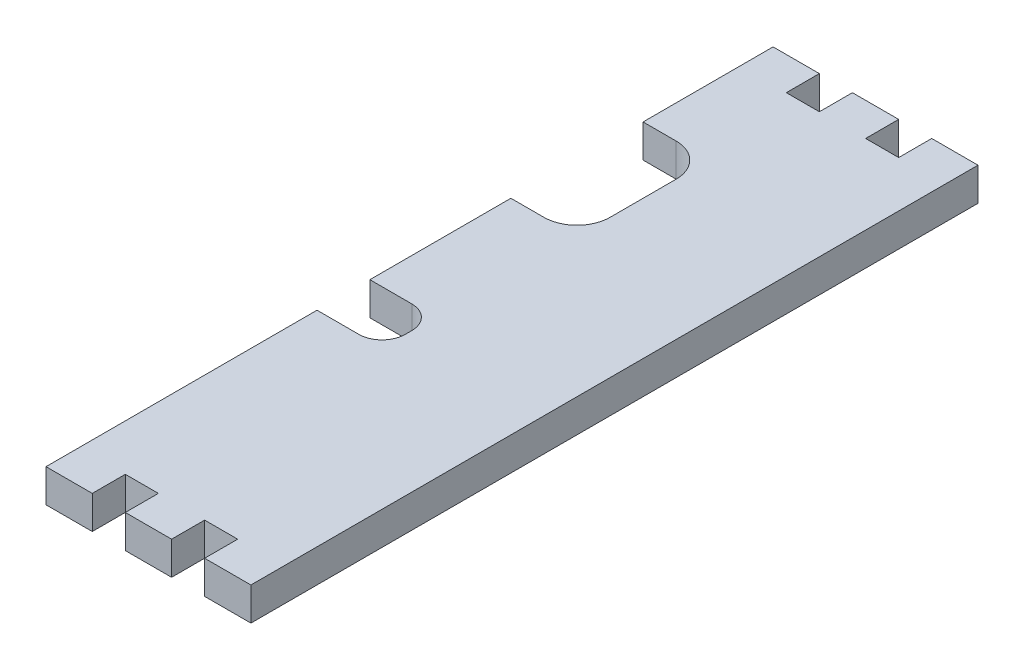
ISO-10303-21;
HEADER;
FILE_DESCRIPTION(('STEP AP214'),'2;1');
FILE_NAME('part.step','',(''),(''),'','','');
FILE_SCHEMA(('AUTOMOTIVE_DESIGN { 1 0 10303 214 1 1 1 1 }'));
ENDSEC;
DATA;
#1=APPLICATION_CONTEXT('core data for automotive mechanical design processes');
#2=APPLICATION_PROTOCOL_DEFINITION('international standard','automotive_design',2000,#1);
#3=PRODUCT_CONTEXT('',#1,'mechanical');
#4=PRODUCT('Part','Part','',(#3));
#5=PRODUCT_RELATED_PRODUCT_CATEGORY('part','',(#4));
#6=PRODUCT_DEFINITION_FORMATION('','',#4);
#7=PRODUCT_DEFINITION_CONTEXT('part definition',#1,'design');
#8=PRODUCT_DEFINITION('design','',#6,#7);
#9=PRODUCT_DEFINITION_SHAPE('','',#8);
#10=(LENGTH_UNIT() NAMED_UNIT(*) SI_UNIT(.MILLI.,.METRE.));
#11=(NAMED_UNIT(*) PLANE_ANGLE_UNIT() SI_UNIT($,.RADIAN.));
#12=(NAMED_UNIT(*) SI_UNIT($,.STERADIAN.) SOLID_ANGLE_UNIT());
#13=UNCERTAINTY_MEASURE_WITH_UNIT(LENGTH_MEASURE(1.E-05),#10,'distance_accuracy_value','');
#14=(GEOMETRIC_REPRESENTATION_CONTEXT(3) GLOBAL_UNCERTAINTY_ASSIGNED_CONTEXT((#13)) GLOBAL_UNIT_ASSIGNED_CONTEXT((#10,
#11,#12)) REPRESENTATION_CONTEXT('',''));
#15=CARTESIAN_POINT('',(0.,0.,0.));
#16=DIRECTION('',(0.,0.,1.));
#17=DIRECTION('',(1.,0.,0.));
#18=AXIS2_PLACEMENT_3D('',#15,#16,#17);
#19=CARTESIAN_POINT('',(0.,0.,100.));
#20=DIRECTION('',(1.,0.,0.));
#21=DIRECTION('',(0.,0.,-1.));
#22=AXIS2_PLACEMENT_3D('',#19,#20,#21);
#23=PLANE('',#22);
#24=DIRECTION('',(0.,0.,-1.));
#25=VECTOR('',#24,1.);
#26=CARTESIAN_POINT('',(0.,5.,100.));
#27=LINE('',#26,#25);
#28=CARTESIAN_POINT('',(0.,5.,56.));
#29=VERTEX_POINT('',#28);
#30=CARTESIAN_POINT('',(0.,5.,34.6685927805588));
#31=VERTEX_POINT('',#30);
#32=EDGE_CURVE('E441',#29,#31,#27,.T.);
#33=ORIENTED_EDGE('',*,*,#32,.T.);
#34=DIRECTION('',(0.,-1.,0.));
#35=VECTOR('',#34,1.);
#36=CARTESIAN_POINT('',(0.,0.,34.6685927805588));
#37=LINE('',#36,#35);
#38=CARTESIAN_POINT('',(0.,0.,34.6685927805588));
#39=VERTEX_POINT('',#38);
#40=EDGE_CURVE('E278',#31,#39,#37,.T.);
#41=ORIENTED_EDGE('',*,*,#40,.T.);
#42=DIRECTION('',(0.,0.,-1.));
#43=VECTOR('',#42,1.);
#44=CARTESIAN_POINT('',(0.,0.,100.));
#45=LINE('',#44,#43);
#46=CARTESIAN_POINT('',(0.,0.,56.));
#47=VERTEX_POINT('',#46);
#48=EDGE_CURVE('E446',#47,#39,#45,.T.);
#49=ORIENTED_EDGE('',*,*,#48,.F.);
#50=DIRECTION('',(0.,1.,0.));
#51=VECTOR('',#50,1.);
#52=CARTESIAN_POINT('',(0.,0.,56.));
#53=LINE('',#52,#51);
#54=EDGE_CURVE('E297',#47,#29,#53,.T.);
#55=ORIENTED_EDGE('',*,*,#54,.T.);
#56=EDGE_LOOP('',(#33,#41,#49,#55));
#57=FACE_BOUND('',#56,.T.);
#58=ADVANCED_FACE('F33',(#57),#23,.F.);
#59=CARTESIAN_POINT('',(0.,0.,14.6685927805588));
#60=VERTEX_POINT('',#59);
#61=CARTESIAN_POINT('',(0.,0.,-4.99999999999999));
#62=VERTEX_POINT('',#61);
#63=EDGE_CURVE('E440',#60,#62,#45,.T.);
#64=ORIENTED_EDGE('',*,*,#63,.F.);
#65=DIRECTION('',(0.,1.,0.));
#66=VECTOR('',#65,1.);
#67=CARTESIAN_POINT('',(0.,0.,14.6685927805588));
#68=LINE('',#67,#66);
#69=CARTESIAN_POINT('',(0.,5.,14.6685927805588));
#70=VERTEX_POINT('',#69);
#71=EDGE_CURVE('E257',#60,#70,#68,.T.);
#72=ORIENTED_EDGE('',*,*,#71,.T.);
#73=CARTESIAN_POINT('',(0.,5.,-4.99999999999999));
#74=VERTEX_POINT('',#73);
#75=EDGE_CURVE('E430',#70,#74,#27,.T.);
#76=ORIENTED_EDGE('',*,*,#75,.T.);
#77=DIRECTION('',(0.,-1.,0.));
#78=VECTOR('',#77,1.);
#79=CARTESIAN_POINT('',(0.,5.,-4.99999999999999));
#80=LINE('',#79,#78);
#81=EDGE_CURVE('E400',#74,#62,#80,.T.);
#82=ORIENTED_EDGE('',*,*,#81,.T.);
#83=EDGE_LOOP('',(#64,#72,#76,#82));
#84=FACE_BOUND('',#83,.T.);
#85=ADVANCED_FACE('F498',(#84),#23,.F.);
#86=CARTESIAN_POINT('',(0.,0.,100.));
#87=DIRECTION('',(0.,0.,-1.));
#88=DIRECTION('',(-1.,0.,0.));
#89=AXIS2_PLACEMENT_3D('',#86,#87,#88);
#90=PLANE('',#89);
#91=DIRECTION('',(1.,0.,0.));
#92=VECTOR('',#91,1.);
#93=CARTESIAN_POINT('',(0.,0.,100.));
#94=LINE('',#93,#92);
#95=CARTESIAN_POINT('',(19.,0.,100.));
#96=VERTEX_POINT('',#95);
#97=CARTESIAN_POINT('',(24.,0.,100.));
#98=VERTEX_POINT('',#97);
#99=EDGE_CURVE('E427',#96,#98,#94,.T.);
#100=ORIENTED_EDGE('',*,*,#99,.T.);
#101=DIRECTION('',(0.,1.,0.));
#102=VECTOR('',#101,1.);
#103=CARTESIAN_POINT('',(24.,0.,100.));
#104=LINE('',#103,#102);
#105=CARTESIAN_POINT('',(24.,5.,100.));
#106=VERTEX_POINT('',#105);
#107=EDGE_CURVE('E340',#98,#106,#104,.T.);
#108=ORIENTED_EDGE('',*,*,#107,.T.);
#109=DIRECTION('',(-1.,0.,0.));
#110=VECTOR('',#109,1.);
#111=CARTESIAN_POINT('',(0.,5.,100.));
#112=LINE('',#111,#110);
#113=CARTESIAN_POINT('',(19.,5.,100.));
#114=VERTEX_POINT('',#113);
#115=EDGE_CURVE('E428',#106,#114,#112,.T.);
#116=ORIENTED_EDGE('',*,*,#115,.T.);
#117=DIRECTION('',(0.,-1.,0.));
#118=VECTOR('',#117,1.);
#119=CARTESIAN_POINT('',(19.,0.,100.));
#120=LINE('',#119,#118);
#121=EDGE_CURVE('E385',#114,#96,#120,.T.);
#122=ORIENTED_EDGE('',*,*,#121,.T.);
#123=EDGE_LOOP('',(#100,#108,#116,#122));
#124=FACE_BOUND('',#123,.T.);
#125=ADVANCED_FACE('F547',(#124),#90,.F.);
#126=CARTESIAN_POINT('',(0.,0.,0.));
#127=DIRECTION('',(0.,0.,-1.));
#128=DIRECTION('',(-1.,0.,0.));
#129=AXIS2_PLACEMENT_3D('',#126,#127,#128);
#130=PLANE('',#129);
#131=DIRECTION('',(0.,1.,0.));
#132=VECTOR('',#131,1.);
#133=CARTESIAN_POINT('',(24.,0.,0.));
#134=LINE('',#133,#132);
#135=CARTESIAN_POINT('',(24.,0.,0.));
#136=VERTEX_POINT('',#135);
#137=CARTESIAN_POINT('',(24.,5.,0.));
#138=VERTEX_POINT('',#137);
#139=EDGE_CURVE('E328',#136,#138,#134,.T.);
#140=ORIENTED_EDGE('',*,*,#139,.F.);
#141=DIRECTION('',(1.,0.,0.));
#142=VECTOR('',#141,1.);
#143=CARTESIAN_POINT('',(0.,0.,0.));
#144=LINE('',#143,#142);
#145=CARTESIAN_POINT('',(19.,0.,0.));
#146=VERTEX_POINT('',#145);
#147=EDGE_CURVE('E422',#146,#136,#144,.T.);
#148=ORIENTED_EDGE('',*,*,#147,.F.);
#149=DIRECTION('',(0.,-1.,0.));
#150=VECTOR('',#149,1.);
#151=CARTESIAN_POINT('',(19.,0.,0.));
#152=LINE('',#151,#150);
#153=CARTESIAN_POINT('',(19.,5.,0.));
#154=VERTEX_POINT('',#153);
#155=EDGE_CURVE('E452',#154,#146,#152,.T.);
#156=ORIENTED_EDGE('',*,*,#155,.F.);
#157=DIRECTION('',(-1.,0.,0.));
#158=VECTOR('',#157,1.);
#159=CARTESIAN_POINT('',(0.,5.,0.));
#160=LINE('',#159,#158);
#161=EDGE_CURVE('E435',#138,#154,#160,.T.);
#162=ORIENTED_EDGE('',*,*,#161,.F.);
#163=EDGE_LOOP('',(#140,#148,#156,#162));
#164=FACE_BOUND('',#163,.T.);
#165=ADVANCED_FACE('F611',(#164),#130,.T.);
#166=CARTESIAN_POINT('',(0.,5.,105.));
#167=VERTEX_POINT('',#166);
#168=CARTESIAN_POINT('',(0.,5.,64.));
#169=VERTEX_POINT('',#168);
#170=EDGE_CURVE('E437',#167,#169,#27,.T.);
#171=ORIENTED_EDGE('',*,*,#170,.T.);
#172=DIRECTION('',(0.,1.,0.));
#173=VECTOR('',#172,1.);
#174=CARTESIAN_POINT('',(0.,0.,64.));
#175=LINE('',#174,#173);
#176=CARTESIAN_POINT('',(0.,0.,64.));
#177=VERTEX_POINT('',#176);
#178=EDGE_CURVE('E290',#177,#169,#175,.T.);
#179=ORIENTED_EDGE('',*,*,#178,.F.);
#180=CARTESIAN_POINT('',(0.,0.,105.));
#181=VERTEX_POINT('',#180);
#182=EDGE_CURVE('E442',#181,#177,#45,.T.);
#183=ORIENTED_EDGE('',*,*,#182,.F.);
#184=DIRECTION('',(0.,-1.,0.));
#185=VECTOR('',#184,1.);
#186=CARTESIAN_POINT('',(0.,5.,105.));
#187=LINE('',#186,#185);
#188=EDGE_CURVE('E388',#167,#181,#187,.T.);
#189=ORIENTED_EDGE('',*,*,#188,.F.);
#190=EDGE_LOOP('',(#171,#179,#183,#189));
#191=FACE_BOUND('',#190,.T.);
#192=ADVANCED_FACE('F575',(#191),#23,.F.);
#193=CARTESIAN_POINT('',(0.,0.,100.));
#194=DIRECTION('',(0.,1.,0.));
#195=DIRECTION('',(0.,0.,1.));
#196=AXIS2_PLACEMENT_3D('',#193,#194,#195);
#197=PLANE('',#196);
#198=ORIENTED_EDGE('',*,*,#48,.T.);
#199=DIRECTION('',(-1.,0.,0.));
#200=VECTOR('',#199,1.);
#201=CARTESIAN_POINT('',(-2.00000000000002,0.,34.6685927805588));
#202=LINE('',#201,#200);
#203=CARTESIAN_POINT('',(4.99999999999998,0.,34.6685927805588));
#204=VERTEX_POINT('',#203);
#205=EDGE_CURVE('E251',#204,#39,#202,.T.);
#206=ORIENTED_EDGE('',*,*,#205,.F.);
#207=CARTESIAN_POINT('',(4.99999999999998,0.,29.6685927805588));
#208=DIRECTION('',(0.,-1.,0.));
#209=DIRECTION('',(0.,0.,1.));
#210=AXIS2_PLACEMENT_3D('',#207,#208,#209);
#211=CIRCLE('',#210,5.);
#212=CARTESIAN_POINT('',(9.99999999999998,0.,29.6685927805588));
#213=VERTEX_POINT('',#212);
#214=EDGE_CURVE('E266',#213,#204,#211,.T.);
#215=ORIENTED_EDGE('',*,*,#214,.F.);
#216=DIRECTION('',(0.,0.,1.));
#217=VECTOR('',#216,1.);
#218=CARTESIAN_POINT('',(9.99999999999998,0.,19.6685927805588));
#219=LINE('',#218,#217);
#220=CARTESIAN_POINT('',(9.99999999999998,0.,19.6685927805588));
#221=VERTEX_POINT('',#220);
#222=EDGE_CURVE('E264',#221,#213,#219,.T.);
#223=ORIENTED_EDGE('',*,*,#222,.F.);
#224=CARTESIAN_POINT('',(4.99999999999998,0.,19.6685927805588));
#225=DIRECTION('',(0.,-1.,0.));
#226=DIRECTION('',(0.,0.,-1.));
#227=AXIS2_PLACEMENT_3D('',#224,#225,#226);
#228=CIRCLE('',#227,5.);
#229=CARTESIAN_POINT('',(4.99999999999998,0.,14.6685927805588));
#230=VERTEX_POINT('',#229);
#231=EDGE_CURVE('E245',#230,#221,#228,.T.);
#232=ORIENTED_EDGE('',*,*,#231,.F.);
#233=DIRECTION('',(1.,0.,0.));
#234=VECTOR('',#233,1.);
#235=CARTESIAN_POINT('',(-2.00000000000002,0.,14.6685927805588));
#236=LINE('',#235,#234);
#237=EDGE_CURVE('E254',#60,#230,#236,.T.);
#238=ORIENTED_EDGE('',*,*,#237,.F.);
#239=ORIENTED_EDGE('',*,*,#63,.T.);
#240=DIRECTION('',(1.,0.,0.));
#241=VECTOR('',#240,1.);
#242=CARTESIAN_POINT('',(0.,0.,-4.99999999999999));
#243=LINE('',#242,#241);
#244=CARTESIAN_POINT('',(7.00000000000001,0.,-4.99999999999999));
#245=VERTEX_POINT('',#244);
#246=EDGE_CURVE('E403',#62,#245,#243,.T.);
#247=ORIENTED_EDGE('',*,*,#246,.T.);
#248=DIRECTION('',(0.,0.,1.));
#249=VECTOR('',#248,1.);
#250=CARTESIAN_POINT('',(7.00000000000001,0.,-4.99999999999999));
#251=LINE('',#250,#249);
#252=CARTESIAN_POINT('',(7.00000000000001,0.,0.));
#253=VERTEX_POINT('',#252);
#254=EDGE_CURVE('E418',#245,#253,#251,.T.);
#255=ORIENTED_EDGE('',*,*,#254,.T.);
#256=CARTESIAN_POINT('',(12.,0.,0.));
#257=VERTEX_POINT('',#256);
#258=EDGE_CURVE('E431',#253,#257,#144,.T.);
#259=ORIENTED_EDGE('',*,*,#258,.T.);
#260=DIRECTION('',(0.,0.,1.));
#261=VECTOR('',#260,1.);
#262=CARTESIAN_POINT('',(12.,0.,-4.99999999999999));
#263=LINE('',#262,#261);
#264=CARTESIAN_POINT('',(12.,0.,-4.99999999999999));
#265=VERTEX_POINT('',#264);
#266=EDGE_CURVE('E376',#265,#257,#263,.T.);
#267=ORIENTED_EDGE('',*,*,#266,.F.);
#268=DIRECTION('',(1.,0.,0.));
#269=VECTOR('',#268,1.);
#270=CARTESIAN_POINT('',(12.,0.,-4.99999999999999));
#271=LINE('',#270,#269);
#272=CARTESIAN_POINT('',(19.,0.,-4.99999999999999));
#273=VERTEX_POINT('',#272);
#274=EDGE_CURVE('E360',#265,#273,#271,.T.);
#275=ORIENTED_EDGE('',*,*,#274,.T.);
#276=DIRECTION('',(0.,0.,1.));
#277=VECTOR('',#276,1.);
#278=CARTESIAN_POINT('',(19.,0.,-4.99999999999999));
#279=LINE('',#278,#277);
#280=EDGE_CURVE('E372',#273,#146,#279,.T.);
#281=ORIENTED_EDGE('',*,*,#280,.T.);
#282=ORIENTED_EDGE('',*,*,#147,.T.);
#283=DIRECTION('',(0.,0.,1.));
#284=VECTOR('',#283,1.);
#285=CARTESIAN_POINT('',(24.,0.,-4.99999999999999));
#286=LINE('',#285,#284);
#287=CARTESIAN_POINT('',(24.,0.,-4.99999999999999));
#288=VERTEX_POINT('',#287);
#289=EDGE_CURVE('E331',#288,#136,#286,.T.);
#290=ORIENTED_EDGE('',*,*,#289,.F.);
#291=DIRECTION('',(1.,0.,0.));
#292=VECTOR('',#291,1.);
#293=CARTESIAN_POINT('',(24.,0.,-4.99999999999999));
#294=LINE('',#293,#292);
#295=CARTESIAN_POINT('',(31.,0.,-4.99999999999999));
#296=VERTEX_POINT('',#295);
#297=EDGE_CURVE('E319',#288,#296,#294,.T.);
#298=ORIENTED_EDGE('',*,*,#297,.T.);
#299=DIRECTION('',(0.,0.,1.));
#300=VECTOR('',#299,1.);
#301=CARTESIAN_POINT('',(31.,0.,-4.99999999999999));
#302=LINE('',#301,#300);
#303=CARTESIAN_POINT('',(31.,0.,105.));
#304=VERTEX_POINT('',#303);
#305=EDGE_CURVE('E329',#296,#304,#302,.T.);
#306=ORIENTED_EDGE('',*,*,#305,.T.);
#307=DIRECTION('',(1.,0.,0.));
#308=VECTOR('',#307,1.);
#309=CARTESIAN_POINT('',(24.,0.,105.));
#310=LINE('',#309,#308);
#311=CARTESIAN_POINT('',(24.,0.,105.));
#312=VERTEX_POINT('',#311);
#313=EDGE_CURVE('E307',#312,#304,#310,.T.);
#314=ORIENTED_EDGE('',*,*,#313,.F.);
#315=EDGE_CURVE('E334',#98,#312,#286,.T.);
#316=ORIENTED_EDGE('',*,*,#315,.F.);
#317=ORIENTED_EDGE('',*,*,#99,.F.);
#318=CARTESIAN_POINT('',(19.,0.,105.));
#319=VERTEX_POINT('',#318);
#320=EDGE_CURVE('E375',#96,#319,#279,.T.);
#321=ORIENTED_EDGE('',*,*,#320,.T.);
#322=DIRECTION('',(1.,0.,0.));
#323=VECTOR('',#322,1.);
#324=CARTESIAN_POINT('',(12.,0.,105.));
#325=LINE('',#324,#323);
#326=CARTESIAN_POINT('',(12.,0.,105.));
#327=VERTEX_POINT('',#326);
#328=EDGE_CURVE('E348',#327,#319,#325,.T.);
#329=ORIENTED_EDGE('',*,*,#328,.F.);
#330=CARTESIAN_POINT('',(12.,0.,100.));
#331=VERTEX_POINT('',#330);
#332=EDGE_CURVE('E379',#331,#327,#263,.T.);
#333=ORIENTED_EDGE('',*,*,#332,.F.);
#334=CARTESIAN_POINT('',(7.00000000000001,0.,100.));
#335=VERTEX_POINT('',#334);
#336=EDGE_CURVE('E423',#335,#331,#94,.T.);
#337=ORIENTED_EDGE('',*,*,#336,.F.);
#338=CARTESIAN_POINT('',(7.00000000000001,0.,105.));
#339=VERTEX_POINT('',#338);
#340=EDGE_CURVE('E412',#335,#339,#251,.T.);
#341=ORIENTED_EDGE('',*,*,#340,.T.);
#342=DIRECTION('',(1.,0.,0.));
#343=VECTOR('',#342,1.);
#344=CARTESIAN_POINT('',(0.,0.,105.));
#345=LINE('',#344,#343);
#346=EDGE_CURVE('E391',#181,#339,#345,.T.);
#347=ORIENTED_EDGE('',*,*,#346,.F.);
#348=ORIENTED_EDGE('',*,*,#182,.T.);
#349=DIRECTION('',(1.,0.,0.));
#350=VECTOR('',#349,1.);
#351=CARTESIAN_POINT('',(9.84067957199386,0.,64.));
#352=LINE('',#351,#350);
#353=CARTESIAN_POINT('',(6.34067957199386,0.,64.));
#354=VERTEX_POINT('',#353);
#355=EDGE_CURVE('E282',#177,#354,#352,.T.);
#356=ORIENTED_EDGE('',*,*,#355,.T.);
#357=CARTESIAN_POINT('',(6.34067957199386,0.,60.5));
#358=DIRECTION('',(0.,1.,0.));
#359=DIRECTION('',(0.,0.,1.));
#360=AXIS2_PLACEMENT_3D('',#357,#358,#359);
#361=CIRCLE('',#360,3.5);
#362=CARTESIAN_POINT('',(9.84067957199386,0.,60.5));
#363=VERTEX_POINT('',#362);
#364=EDGE_CURVE('E467',#354,#363,#361,.T.);
#365=ORIENTED_EDGE('',*,*,#364,.T.);
#366=DIRECTION('',(0.,0.,-1.));
#367=VECTOR('',#366,1.);
#368=CARTESIAN_POINT('',(9.84067957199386,0.,56.));
#369=LINE('',#368,#367);
#370=CARTESIAN_POINT('',(9.84067957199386,0.,59.5));
#371=VERTEX_POINT('',#370);
#372=EDGE_CURVE('E285',#363,#371,#369,.T.);
#373=ORIENTED_EDGE('',*,*,#372,.T.);
#374=CARTESIAN_POINT('',(6.34067957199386,0.,59.5));
#375=DIRECTION('',(0.,1.,0.));
#376=DIRECTION('',(0.,0.,1.));
#377=AXIS2_PLACEMENT_3D('',#374,#375,#376);
#378=CIRCLE('',#377,3.5);
#379=CARTESIAN_POINT('',(6.34067957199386,0.,56.));
#380=VERTEX_POINT('',#379);
#381=EDGE_CURVE('E56',#371,#380,#378,.T.);
#382=ORIENTED_EDGE('',*,*,#381,.T.);
#383=DIRECTION('',(-1.,0.,0.));
#384=VECTOR('',#383,1.);
#385=CARTESIAN_POINT('',(9.84067957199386,0.,56.));
#386=LINE('',#385,#384);
#387=EDGE_CURVE('E288',#380,#47,#386,.T.);
#388=ORIENTED_EDGE('',*,*,#387,.T.);
#389=EDGE_LOOP('',(#198,#206,#215,#223,#232,#238,#239,#247,#255,#259,#267,#275,#281,#282,#290,
#298,#306,#314,#316,#317,#321,#329,#333,#337,#341,#347,#348,#356,#365,#373,#382,#388));
#390=FACE_BOUND('',#389,.T.);
#391=ADVANCED_FACE('F261',(#390),#197,.F.);
#392=CARTESIAN_POINT('',(0.,5.,100.));
#393=DIRECTION('',(0.,-1.,0.));
#394=DIRECTION('',(0.,0.,-1.));
#395=AXIS2_PLACEMENT_3D('',#392,#393,#394);
#396=PLANE('',#395);
#397=CARTESIAN_POINT('',(4.99999999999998,5.,29.6685927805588));
#398=DIRECTION('',(0.,-1.,0.));
#399=DIRECTION('',(0.,0.,-1.));
#400=AXIS2_PLACEMENT_3D('',#397,#398,#399);
#401=CIRCLE('',#400,5.);
#402=CARTESIAN_POINT('',(9.99999999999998,5.,29.6685927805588));
#403=VERTEX_POINT('',#402);
#404=CARTESIAN_POINT('',(4.99999999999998,5.,34.6685927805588));
#405=VERTEX_POINT('',#404);
#406=EDGE_CURVE('E41',#403,#405,#401,.T.);
#407=ORIENTED_EDGE('',*,*,#406,.T.);
#408=DIRECTION('',(-1.,0.,0.));
#409=VECTOR('',#408,1.);
#410=CARTESIAN_POINT('',(0.,5.,34.6685927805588));
#411=LINE('',#410,#409);
#412=EDGE_CURVE('E11',#405,#31,#411,.T.);
#413=ORIENTED_EDGE('',*,*,#412,.T.);
#414=ORIENTED_EDGE('',*,*,#32,.F.);
#415=DIRECTION('',(-1.,0.,0.));
#416=VECTOR('',#415,1.);
#417=CARTESIAN_POINT('',(9.84067957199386,5.,56.));
#418=LINE('',#417,#416);
#419=CARTESIAN_POINT('',(6.34067957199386,5.,56.));
#420=VERTEX_POINT('',#419);
#421=EDGE_CURVE('E286',#420,#29,#418,.T.);
#422=ORIENTED_EDGE('',*,*,#421,.F.);
#423=CARTESIAN_POINT('',(6.34067957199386,5.,59.5));
#424=DIRECTION('',(0.,-1.,0.));
#425=DIRECTION('',(0.,0.,-1.));
#426=AXIS2_PLACEMENT_3D('',#423,#424,#425);
#427=CIRCLE('',#426,3.5);
#428=CARTESIAN_POINT('',(9.84067957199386,5.,59.5));
#429=VERTEX_POINT('',#428);
#430=EDGE_CURVE('E469',#420,#429,#427,.T.);
#431=ORIENTED_EDGE('',*,*,#430,.T.);
#432=DIRECTION('',(0.,0.,-1.));
#433=VECTOR('',#432,1.);
#434=CARTESIAN_POINT('',(9.84067957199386,5.,56.));
#435=LINE('',#434,#433);
#436=CARTESIAN_POINT('',(9.84067957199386,5.,60.5));
#437=VERTEX_POINT('',#436);
#438=EDGE_CURVE('E293',#437,#429,#435,.T.);
#439=ORIENTED_EDGE('',*,*,#438,.F.);
#440=CARTESIAN_POINT('',(6.34067957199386,5.,60.5));
#441=DIRECTION('',(0.,-1.,0.));
#442=DIRECTION('',(0.,0.,-1.));
#443=AXIS2_PLACEMENT_3D('',#440,#441,#442);
#444=CIRCLE('',#443,3.5);
#445=CARTESIAN_POINT('',(6.34067957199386,5.,64.));
#446=VERTEX_POINT('',#445);
#447=EDGE_CURVE('E465',#437,#446,#444,.T.);
#448=ORIENTED_EDGE('',*,*,#447,.T.);
#449=DIRECTION('',(1.,0.,0.));
#450=VECTOR('',#449,1.);
#451=CARTESIAN_POINT('',(9.84067957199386,5.,64.));
#452=LINE('',#451,#450);
#453=EDGE_CURVE('E281',#169,#446,#452,.T.);
#454=ORIENTED_EDGE('',*,*,#453,.F.);
#455=ORIENTED_EDGE('',*,*,#170,.F.);
#456=DIRECTION('',(-1.,0.,0.));
#457=VECTOR('',#456,1.);
#458=CARTESIAN_POINT('',(0.,5.,105.));
#459=LINE('',#458,#457);
#460=CARTESIAN_POINT('',(7.00000000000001,5.,105.));
#461=VERTEX_POINT('',#460);
#462=EDGE_CURVE('E397',#461,#167,#459,.T.);
#463=ORIENTED_EDGE('',*,*,#462,.F.);
#464=DIRECTION('',(0.,0.,1.));
#465=VECTOR('',#464,1.);
#466=CARTESIAN_POINT('',(7.00000000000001,5.,-4.99999999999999));
#467=LINE('',#466,#465);
#468=CARTESIAN_POINT('',(7.00000000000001,5.,100.));
#469=VERTEX_POINT('',#468);
#470=EDGE_CURVE('E417',#469,#461,#467,.T.);
#471=ORIENTED_EDGE('',*,*,#470,.F.);
#472=CARTESIAN_POINT('',(12.,5.,100.));
#473=VERTEX_POINT('',#472);
#474=EDGE_CURVE('E426',#473,#469,#112,.T.);
#475=ORIENTED_EDGE('',*,*,#474,.F.);
#476=DIRECTION('',(0.,0.,1.));
#477=VECTOR('',#476,1.);
#478=CARTESIAN_POINT('',(12.,5.,-4.99999999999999));
#479=LINE('',#478,#477);
#480=CARTESIAN_POINT('',(12.,5.,105.));
#481=VERTEX_POINT('',#480);
#482=EDGE_CURVE('E366',#473,#481,#479,.T.);
#483=ORIENTED_EDGE('',*,*,#482,.T.);
#484=DIRECTION('',(-1.,0.,0.));
#485=VECTOR('',#484,1.);
#486=CARTESIAN_POINT('',(12.,5.,105.));
#487=LINE('',#486,#485);
#488=CARTESIAN_POINT('',(19.,5.,105.));
#489=VERTEX_POINT('',#488);
#490=EDGE_CURVE('E342',#489,#481,#487,.T.);
#491=ORIENTED_EDGE('',*,*,#490,.F.);
#492=DIRECTION('',(0.,0.,1.));
#493=VECTOR('',#492,1.);
#494=CARTESIAN_POINT('',(19.,5.,-4.99999999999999));
#495=LINE('',#494,#493);
#496=EDGE_CURVE('E371',#114,#489,#495,.T.);
#497=ORIENTED_EDGE('',*,*,#496,.F.);
#498=ORIENTED_EDGE('',*,*,#115,.F.);
#499=DIRECTION('',(0.,0.,1.));
#500=VECTOR('',#499,1.);
#501=CARTESIAN_POINT('',(24.,5.,-4.99999999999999));
#502=LINE('',#501,#500);
#503=CARTESIAN_POINT('',(24.,5.,105.));
#504=VERTEX_POINT('',#503);
#505=EDGE_CURVE('E325',#106,#504,#502,.T.);
#506=ORIENTED_EDGE('',*,*,#505,.T.);
#507=DIRECTION('',(-1.,0.,0.));
#508=VECTOR('',#507,1.);
#509=CARTESIAN_POINT('',(24.,5.,105.));
#510=LINE('',#509,#508);
#511=CARTESIAN_POINT('',(31.,5.,105.));
#512=VERTEX_POINT('',#511);
#513=EDGE_CURVE('E300',#512,#504,#510,.T.);
#514=ORIENTED_EDGE('',*,*,#513,.F.);
#515=DIRECTION('',(0.,0.,1.));
#516=VECTOR('',#515,1.);
#517=CARTESIAN_POINT('',(31.,5.,-4.99999999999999));
#518=LINE('',#517,#516);
#519=CARTESIAN_POINT('',(31.,5.,-4.99999999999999));
#520=VERTEX_POINT('',#519);
#521=EDGE_CURVE('E326',#520,#512,#518,.T.);
#522=ORIENTED_EDGE('',*,*,#521,.F.);
#523=DIRECTION('',(-1.,0.,0.));
#524=VECTOR('',#523,1.);
#525=CARTESIAN_POINT('',(24.,5.,-4.99999999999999));
#526=LINE('',#525,#524);
#527=CARTESIAN_POINT('',(24.,5.,-4.99999999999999));
#528=VERTEX_POINT('',#527);
#529=EDGE_CURVE('E313',#520,#528,#526,.T.);
#530=ORIENTED_EDGE('',*,*,#529,.T.);
#531=EDGE_CURVE('E335',#528,#138,#502,.T.);
#532=ORIENTED_EDGE('',*,*,#531,.T.);
#533=ORIENTED_EDGE('',*,*,#161,.T.);
#534=CARTESIAN_POINT('',(19.,5.,-4.99999999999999));
#535=VERTEX_POINT('',#534);
#536=EDGE_CURVE('E367',#535,#154,#495,.T.);
#537=ORIENTED_EDGE('',*,*,#536,.F.);
#538=DIRECTION('',(-1.,0.,0.));
#539=VECTOR('',#538,1.);
#540=CARTESIAN_POINT('',(12.,5.,-4.99999999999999));
#541=LINE('',#540,#539);
#542=CARTESIAN_POINT('',(12.,5.,-4.99999999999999));
#543=VERTEX_POINT('',#542);
#544=EDGE_CURVE('E354',#535,#543,#541,.T.);
#545=ORIENTED_EDGE('',*,*,#544,.T.);
#546=CARTESIAN_POINT('',(12.,5.,0.));
#547=VERTEX_POINT('',#546);
#548=EDGE_CURVE('E380',#543,#547,#479,.T.);
#549=ORIENTED_EDGE('',*,*,#548,.T.);
#550=CARTESIAN_POINT('',(7.00000000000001,5.,0.));
#551=VERTEX_POINT('',#550);
#552=EDGE_CURVE('E434',#547,#551,#160,.T.);
#553=ORIENTED_EDGE('',*,*,#552,.T.);
#554=CARTESIAN_POINT('',(7.00000000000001,5.,-4.99999999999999));
#555=VERTEX_POINT('',#554);
#556=EDGE_CURVE('E413',#555,#551,#467,.T.);
#557=ORIENTED_EDGE('',*,*,#556,.F.);
#558=DIRECTION('',(-1.,0.,0.));
#559=VECTOR('',#558,1.);
#560=CARTESIAN_POINT('',(0.,5.,-4.99999999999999));
#561=LINE('',#560,#559);
#562=EDGE_CURVE('E409',#555,#74,#561,.T.);
#563=ORIENTED_EDGE('',*,*,#562,.T.);
#564=ORIENTED_EDGE('',*,*,#75,.F.);
#565=DIRECTION('',(1.,0.,0.));
#566=VECTOR('',#565,1.);
#567=CARTESIAN_POINT('',(0.,5.,14.6685927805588));
#568=LINE('',#567,#566);
#569=CARTESIAN_POINT('',(4.99999999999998,5.,14.6685927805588));
#570=VERTEX_POINT('',#569);
#571=EDGE_CURVE('E472',#70,#570,#568,.T.);
#572=ORIENTED_EDGE('',*,*,#571,.T.);
#573=CARTESIAN_POINT('',(4.99999999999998,5.,19.6685927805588));
#574=DIRECTION('',(0.,-1.,0.));
#575=DIRECTION('',(0.,0.,-1.));
#576=AXIS2_PLACEMENT_3D('',#573,#574,#575);
#577=CIRCLE('',#576,5.);
#578=CARTESIAN_POINT('',(9.99999999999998,5.,19.6685927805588));
#579=VERTEX_POINT('',#578);
#580=EDGE_CURVE('E248',#570,#579,#577,.T.);
#581=ORIENTED_EDGE('',*,*,#580,.T.);
#582=DIRECTION('',(0.,0.,1.));
#583=VECTOR('',#582,1.);
#584=CARTESIAN_POINT('',(9.99999999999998,5.,100.));
#585=LINE('',#584,#583);
#586=EDGE_CURVE('E475',#579,#403,#585,.T.);
#587=ORIENTED_EDGE('',*,*,#586,.T.);
#588=EDGE_LOOP('',(#407,#413,#414,#422,#431,#439,#448,#454,#455,#463,#471,#475,#483,#491,#497,
#498,#506,#514,#522,#530,#532,#533,#537,#545,#549,#553,#557,#563,#564,#572,#581,#587));
#589=FACE_BOUND('',#588,.T.);
#590=ADVANCED_FACE('F479',(#589),#396,.F.);
#591=ORIENTED_EDGE('',*,*,#336,.T.);
#592=DIRECTION('',(0.,1.,0.));
#593=VECTOR('',#592,1.);
#594=CARTESIAN_POINT('',(12.,0.,100.));
#595=LINE('',#594,#593);
#596=EDGE_CURVE('E370',#331,#473,#595,.T.);
#597=ORIENTED_EDGE('',*,*,#596,.T.);
#598=ORIENTED_EDGE('',*,*,#474,.T.);
#599=DIRECTION('',(0.,-1.,0.));
#600=VECTOR('',#599,1.);
#601=CARTESIAN_POINT('',(7.00000000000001,0.,100.));
#602=LINE('',#601,#600);
#603=EDGE_CURVE('E416',#469,#335,#602,.T.);
#604=ORIENTED_EDGE('',*,*,#603,.T.);
#605=EDGE_LOOP('',(#591,#597,#598,#604));
#606=FACE_BOUND('',#605,.T.);
#607=ADVANCED_FACE('F561',(#606),#90,.F.);
#608=DIRECTION('',(0.,1.,0.));
#609=VECTOR('',#608,1.);
#610=CARTESIAN_POINT('',(12.,0.,0.));
#611=LINE('',#610,#609);
#612=EDGE_CURVE('E449',#257,#547,#611,.T.);
#613=ORIENTED_EDGE('',*,*,#612,.F.);
#614=ORIENTED_EDGE('',*,*,#258,.F.);
#615=DIRECTION('',(0.,-1.,0.));
#616=VECTOR('',#615,1.);
#617=CARTESIAN_POINT('',(7.00000000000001,0.,0.));
#618=LINE('',#617,#616);
#619=EDGE_CURVE('E445',#551,#253,#618,.T.);
#620=ORIENTED_EDGE('',*,*,#619,.F.);
#621=ORIENTED_EDGE('',*,*,#552,.F.);
#622=EDGE_LOOP('',(#613,#614,#620,#621));
#623=FACE_BOUND('',#622,.T.);
#624=ADVANCED_FACE('F509',(#623),#130,.T.);
#625=CARTESIAN_POINT('',(0.,0.,-4.99999999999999));
#626=DIRECTION('',(0.,0.,1.));
#627=DIRECTION('',(1.,0.,0.));
#628=AXIS2_PLACEMENT_3D('',#625,#626,#627);
#629=PLANE('',#628);
#630=ORIENTED_EDGE('',*,*,#81,.F.);
#631=ORIENTED_EDGE('',*,*,#562,.F.);
#632=DIRECTION('',(0.,1.,0.));
#633=VECTOR('',#632,1.);
#634=CARTESIAN_POINT('',(7.00000000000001,5.,-4.99999999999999));
#635=LINE('',#634,#633);
#636=EDGE_CURVE('E406',#245,#555,#635,.T.);
#637=ORIENTED_EDGE('',*,*,#636,.F.);
#638=ORIENTED_EDGE('',*,*,#246,.F.);
#639=EDGE_LOOP('',(#630,#631,#637,#638));
#640=FACE_BOUND('',#639,.T.);
#641=ADVANCED_FACE('F502',(#640),#629,.F.);
#642=CARTESIAN_POINT('',(7.00000000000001,5.,-4.99999999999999));
#643=DIRECTION('',(1.,0.,0.));
#644=DIRECTION('',(0.,0.,-1.));
#645=AXIS2_PLACEMENT_3D('',#642,#643,#644);
#646=PLANE('',#645);
#647=ORIENTED_EDGE('',*,*,#556,.T.);
#648=ORIENTED_EDGE('',*,*,#619,.T.);
#649=ORIENTED_EDGE('',*,*,#254,.F.);
#650=ORIENTED_EDGE('',*,*,#636,.T.);
#651=EDGE_LOOP('',(#647,#648,#649,#650));
#652=FACE_BOUND('',#651,.T.);
#653=ADVANCED_FACE('F506',(#652),#646,.T.);
#654=ORIENTED_EDGE('',*,*,#603,.F.);
#655=ORIENTED_EDGE('',*,*,#470,.T.);
#656=DIRECTION('',(0.,1.,0.));
#657=VECTOR('',#656,1.);
#658=CARTESIAN_POINT('',(7.00000000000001,5.,105.));
#659=LINE('',#658,#657);
#660=EDGE_CURVE('E394',#339,#461,#659,.T.);
#661=ORIENTED_EDGE('',*,*,#660,.F.);
#662=ORIENTED_EDGE('',*,*,#340,.F.);
#663=EDGE_LOOP('',(#654,#655,#661,#662));
#664=FACE_BOUND('',#663,.T.);
#665=ADVANCED_FACE('F568',(#664),#646,.T.);
#666=CARTESIAN_POINT('',(0.,0.,105.));
#667=DIRECTION('',(0.,0.,1.));
#668=DIRECTION('',(1.,0.,0.));
#669=AXIS2_PLACEMENT_3D('',#666,#667,#668);
#670=PLANE('',#669);
#671=ORIENTED_EDGE('',*,*,#188,.T.);
#672=ORIENTED_EDGE('',*,*,#346,.T.);
#673=ORIENTED_EDGE('',*,*,#660,.T.);
#674=ORIENTED_EDGE('',*,*,#462,.T.);
#675=EDGE_LOOP('',(#671,#672,#673,#674));
#676=FACE_BOUND('',#675,.T.);
#677=ADVANCED_FACE('F571',(#676),#670,.T.);
#678=CARTESIAN_POINT('',(0.,0.,-4.99999999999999));
#679=DIRECTION('',(0.,0.,-1.));
#680=DIRECTION('',(-1.,0.,0.));
#681=AXIS2_PLACEMENT_3D('',#678,#679,#680);
#682=PLANE('',#681);
#683=ORIENTED_EDGE('',*,*,#544,.F.);
#684=DIRECTION('',(0.,1.,0.));
#685=VECTOR('',#684,1.);
#686=CARTESIAN_POINT('',(19.,5.,-4.99999999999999));
#687=LINE('',#686,#685);
#688=EDGE_CURVE('E363',#273,#535,#687,.T.);
#689=ORIENTED_EDGE('',*,*,#688,.F.);
#690=ORIENTED_EDGE('',*,*,#274,.F.);
#691=DIRECTION('',(0.,-1.,0.));
#692=VECTOR('',#691,1.);
#693=CARTESIAN_POINT('',(12.,5.,-4.99999999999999));
#694=LINE('',#693,#692);
#695=EDGE_CURVE('E357',#543,#265,#694,.T.);
#696=ORIENTED_EDGE('',*,*,#695,.F.);
#697=EDGE_LOOP('',(#683,#689,#690,#696));
#698=FACE_BOUND('',#697,.T.);
#699=ADVANCED_FACE('F516',(#698),#682,.T.);
#700=CARTESIAN_POINT('',(12.,5.,-4.99999999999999));
#701=DIRECTION('',(-1.,0.,0.));
#702=DIRECTION('',(0.,0.,1.));
#703=AXIS2_PLACEMENT_3D('',#700,#701,#702);
#704=PLANE('',#703);
#705=ORIENTED_EDGE('',*,*,#266,.T.);
#706=ORIENTED_EDGE('',*,*,#612,.T.);
#707=ORIENTED_EDGE('',*,*,#548,.F.);
#708=ORIENTED_EDGE('',*,*,#695,.T.);
#709=EDGE_LOOP('',(#705,#706,#707,#708));
#710=FACE_BOUND('',#709,.T.);
#711=ADVANCED_FACE('F511',(#710),#704,.T.);
#712=CARTESIAN_POINT('',(19.,5.,-4.99999999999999));
#713=DIRECTION('',(1.,0.,0.));
#714=DIRECTION('',(0.,1.,0.));
#715=AXIS2_PLACEMENT_3D('',#712,#713,#714);
#716=PLANE('',#715);
#717=ORIENTED_EDGE('',*,*,#536,.T.);
#718=ORIENTED_EDGE('',*,*,#155,.T.);
#719=ORIENTED_EDGE('',*,*,#280,.F.);
#720=ORIENTED_EDGE('',*,*,#688,.T.);
#721=EDGE_LOOP('',(#717,#718,#719,#720));
#722=FACE_BOUND('',#721,.T.);
#723=ADVANCED_FACE('F519',(#722),#716,.T.);
#724=ORIENTED_EDGE('',*,*,#121,.F.);
#725=ORIENTED_EDGE('',*,*,#496,.T.);
#726=DIRECTION('',(0.,1.,0.));
#727=VECTOR('',#726,1.);
#728=CARTESIAN_POINT('',(19.,5.,105.));
#729=LINE('',#728,#727);
#730=EDGE_CURVE('E351',#319,#489,#729,.T.);
#731=ORIENTED_EDGE('',*,*,#730,.F.);
#732=ORIENTED_EDGE('',*,*,#320,.F.);
#733=EDGE_LOOP('',(#724,#725,#731,#732));
#734=FACE_BOUND('',#733,.T.);
#735=ADVANCED_FACE('F553',(#734),#716,.T.);
#736=ORIENTED_EDGE('',*,*,#596,.F.);
#737=ORIENTED_EDGE('',*,*,#332,.T.);
#738=DIRECTION('',(0.,-1.,0.));
#739=VECTOR('',#738,1.);
#740=CARTESIAN_POINT('',(12.,5.,105.));
#741=LINE('',#740,#739);
#742=EDGE_CURVE('E345',#481,#327,#741,.T.);
#743=ORIENTED_EDGE('',*,*,#742,.F.);
#744=ORIENTED_EDGE('',*,*,#482,.F.);
#745=EDGE_LOOP('',(#736,#737,#743,#744));
#746=FACE_BOUND('',#745,.T.);
#747=ADVANCED_FACE('F640',(#746),#704,.T.);
#748=CARTESIAN_POINT('',(0.,0.,105.));
#749=DIRECTION('',(0.,0.,-1.));
#750=DIRECTION('',(-1.,0.,0.));
#751=AXIS2_PLACEMENT_3D('',#748,#749,#750);
#752=PLANE('',#751);
#753=ORIENTED_EDGE('',*,*,#490,.T.);
#754=ORIENTED_EDGE('',*,*,#742,.T.);
#755=ORIENTED_EDGE('',*,*,#328,.T.);
#756=ORIENTED_EDGE('',*,*,#730,.T.);
#757=EDGE_LOOP('',(#753,#754,#755,#756));
#758=FACE_BOUND('',#757,.T.);
#759=ADVANCED_FACE('F555',(#758),#752,.F.);
#760=CARTESIAN_POINT('',(24.,5.,-4.99999999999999));
#761=DIRECTION('',(-1.,0.,0.));
#762=DIRECTION('',(0.,0.,1.));
#763=AXIS2_PLACEMENT_3D('',#760,#761,#762);
#764=PLANE('',#763);
#765=ORIENTED_EDGE('',*,*,#107,.F.);
#766=ORIENTED_EDGE('',*,*,#315,.T.);
#767=DIRECTION('',(0.,-1.,0.));
#768=VECTOR('',#767,1.);
#769=CARTESIAN_POINT('',(24.,5.,105.));
#770=LINE('',#769,#768);
#771=EDGE_CURVE('E304',#504,#312,#770,.T.);
#772=ORIENTED_EDGE('',*,*,#771,.F.);
#773=ORIENTED_EDGE('',*,*,#505,.F.);
#774=EDGE_LOOP('',(#765,#766,#772,#773));
#775=FACE_BOUND('',#774,.T.);
#776=ADVANCED_FACE('F543',(#775),#764,.T.);
#777=CARTESIAN_POINT('',(31.,5.,-4.99999999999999));
#778=DIRECTION('',(1.,0.,0.));
#779=DIRECTION('',(0.,0.,-1.));
#780=AXIS2_PLACEMENT_3D('',#777,#778,#779);
#781=PLANE('',#780);
#782=ORIENTED_EDGE('',*,*,#521,.T.);
#783=DIRECTION('',(0.,1.,0.));
#784=VECTOR('',#783,1.);
#785=CARTESIAN_POINT('',(31.,5.,105.));
#786=LINE('',#785,#784);
#787=EDGE_CURVE('E310',#304,#512,#786,.T.);
#788=ORIENTED_EDGE('',*,*,#787,.F.);
#789=ORIENTED_EDGE('',*,*,#305,.F.);
#790=DIRECTION('',(0.,1.,0.));
#791=VECTOR('',#790,1.);
#792=CARTESIAN_POINT('',(31.,5.,-4.99999999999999));
#793=LINE('',#792,#791);
#794=EDGE_CURVE('E322',#296,#520,#793,.T.);
#795=ORIENTED_EDGE('',*,*,#794,.T.);
#796=EDGE_LOOP('',(#782,#788,#789,#795));
#797=FACE_BOUND('',#796,.T.);
#798=ADVANCED_FACE('F534',(#797),#781,.T.);
#799=ORIENTED_EDGE('',*,*,#289,.T.);
#800=ORIENTED_EDGE('',*,*,#139,.T.);
#801=ORIENTED_EDGE('',*,*,#531,.F.);
#802=DIRECTION('',(0.,-1.,0.));
#803=VECTOR('',#802,1.);
#804=CARTESIAN_POINT('',(24.,5.,-4.99999999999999));
#805=LINE('',#804,#803);
#806=EDGE_CURVE('E316',#528,#288,#805,.T.);
#807=ORIENTED_EDGE('',*,*,#806,.T.);
#808=EDGE_LOOP('',(#799,#800,#801,#807));
#809=FACE_BOUND('',#808,.T.);
#810=ADVANCED_FACE('F525',(#809),#764,.T.);
#811=CARTESIAN_POINT('',(0.,0.,-4.99999999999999));
#812=DIRECTION('',(0.,0.,-1.));
#813=DIRECTION('',(-1.,0.,0.));
#814=AXIS2_PLACEMENT_3D('',#811,#812,#813);
#815=PLANE('',#814);
#816=ORIENTED_EDGE('',*,*,#529,.F.);
#817=ORIENTED_EDGE('',*,*,#794,.F.);
#818=ORIENTED_EDGE('',*,*,#297,.F.);
#819=ORIENTED_EDGE('',*,*,#806,.F.);
#820=EDGE_LOOP('',(#816,#817,#818,#819));
#821=FACE_BOUND('',#820,.T.);
#822=ADVANCED_FACE('F529',(#821),#815,.T.);
#823=CARTESIAN_POINT('',(0.,0.,105.));
#824=DIRECTION('',(0.,0.,-1.));
#825=DIRECTION('',(-1.,0.,0.));
#826=AXIS2_PLACEMENT_3D('',#823,#824,#825);
#827=PLANE('',#826);
#828=ORIENTED_EDGE('',*,*,#513,.T.);
#829=ORIENTED_EDGE('',*,*,#771,.T.);
#830=ORIENTED_EDGE('',*,*,#313,.T.);
#831=ORIENTED_EDGE('',*,*,#787,.T.);
#832=EDGE_LOOP('',(#828,#829,#830,#831));
#833=FACE_BOUND('',#832,.T.);
#834=ADVANCED_FACE('F536',(#833),#827,.F.);
#835=CARTESIAN_POINT('',(9.84067957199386,0.,56.));
#836=DIRECTION('',(0.,0.,-1.));
#837=DIRECTION('',(-1.,0.,0.));
#838=AXIS2_PLACEMENT_3D('',#835,#836,#837);
#839=PLANE('',#838);
#840=ORIENTED_EDGE('',*,*,#387,.F.);
#841=DIRECTION('',(0.,1.,0.));
#842=VECTOR('',#841,1.);
#843=CARTESIAN_POINT('',(6.34067957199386,5.,56.));
#844=LINE('',#843,#842);
#845=EDGE_CURVE('E462',#380,#420,#844,.T.);
#846=ORIENTED_EDGE('',*,*,#845,.T.);
#847=ORIENTED_EDGE('',*,*,#421,.T.);
#848=ORIENTED_EDGE('',*,*,#54,.F.);
#849=EDGE_LOOP('',(#840,#846,#847,#848));
#850=FACE_BOUND('',#849,.T.);
#851=ADVANCED_FACE('F592',(#850),#839,.F.);
#852=CARTESIAN_POINT('',(9.84067957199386,0.,56.));
#853=DIRECTION('',(1.,0.,0.));
#854=DIRECTION('',(0.,0.,-1.));
#855=AXIS2_PLACEMENT_3D('',#852,#853,#854);
#856=PLANE('',#855);
#857=ORIENTED_EDGE('',*,*,#372,.F.);
#858=DIRECTION('',(0.,1.,0.));
#859=VECTOR('',#858,1.);
#860=CARTESIAN_POINT('',(9.84067957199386,5.,60.5));
#861=LINE('',#860,#859);
#862=EDGE_CURVE('E457',#363,#437,#861,.T.);
#863=ORIENTED_EDGE('',*,*,#862,.T.);
#864=ORIENTED_EDGE('',*,*,#438,.T.);
#865=DIRECTION('',(0.,1.,0.));
#866=VECTOR('',#865,1.);
#867=CARTESIAN_POINT('',(9.84067957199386,0.,59.5));
#868=LINE('',#867,#866);
#869=EDGE_CURVE('E455',#429,#371,#868,.F.);
#870=ORIENTED_EDGE('',*,*,#869,.T.);
#871=EDGE_LOOP('',(#857,#863,#864,#870));
#872=FACE_BOUND('',#871,.T.);
#873=ADVANCED_FACE('F586',(#872),#856,.F.);
#874=CARTESIAN_POINT('',(9.84067957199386,0.,64.));
#875=DIRECTION('',(0.,0.,1.));
#876=DIRECTION('',(1.,0.,0.));
#877=AXIS2_PLACEMENT_3D('',#874,#875,#876);
#878=PLANE('',#877);
#879=ORIENTED_EDGE('',*,*,#453,.T.);
#880=DIRECTION('',(0.,1.,0.));
#881=VECTOR('',#880,1.);
#882=CARTESIAN_POINT('',(6.34067957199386,0.,64.));
#883=LINE('',#882,#881);
#884=EDGE_CURVE('E460',#446,#354,#883,.F.);
#885=ORIENTED_EDGE('',*,*,#884,.T.);
#886=ORIENTED_EDGE('',*,*,#355,.F.);
#887=ORIENTED_EDGE('',*,*,#178,.T.);
#888=EDGE_LOOP('',(#879,#885,#886,#887));
#889=FACE_BOUND('',#888,.T.);
#890=ADVANCED_FACE('F599',(#889),#878,.F.);
#891=CARTESIAN_POINT('',(6.34067957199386,0.,60.5));
#892=DIRECTION('',(0.,-1.,0.));
#893=DIRECTION('',(0.,0.,-1.));
#894=AXIS2_PLACEMENT_3D('',#891,#892,#893);
#895=CYLINDRICAL_SURFACE('',#894,3.5);
#896=ORIENTED_EDGE('',*,*,#364,.F.);
#897=ORIENTED_EDGE('',*,*,#884,.F.);
#898=ORIENTED_EDGE('',*,*,#447,.F.);
#899=ORIENTED_EDGE('',*,*,#862,.F.);
#900=EDGE_LOOP('',(#896,#897,#898,#899));
#901=FACE_BOUND('',#900,.T.);
#902=ADVANCED_FACE('F583',(#901),#895,.F.);
#903=CARTESIAN_POINT('',(6.34067957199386,0.,59.5));
#904=DIRECTION('',(0.,-1.,0.));
#905=DIRECTION('',(0.,0.,-1.));
#906=AXIS2_PLACEMENT_3D('',#903,#904,#905);
#907=CYLINDRICAL_SURFACE('',#906,3.5);
#908=ORIENTED_EDGE('',*,*,#381,.F.);
#909=ORIENTED_EDGE('',*,*,#869,.F.);
#910=ORIENTED_EDGE('',*,*,#430,.F.);
#911=ORIENTED_EDGE('',*,*,#845,.F.);
#912=EDGE_LOOP('',(#908,#909,#910,#911));
#913=FACE_BOUND('',#912,.T.);
#914=ADVANCED_FACE('F35',(#913),#907,.F.);
#915=CARTESIAN_POINT('',(-2.00000000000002,10.,34.6685927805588));
#916=DIRECTION('',(0.,0.,1.));
#917=DIRECTION('',(1.,0.,0.));
#918=AXIS2_PLACEMENT_3D('',#915,#916,#917);
#919=PLANE('',#918);
#920=ORIENTED_EDGE('',*,*,#412,.F.);
#921=DIRECTION('',(0.,-1.,0.));
#922=VECTOR('',#921,1.);
#923=CARTESIAN_POINT('',(4.99999999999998,10.,34.6685927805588));
#924=LINE('',#923,#922);
#925=EDGE_CURVE('E272',#405,#204,#924,.T.);
#926=ORIENTED_EDGE('',*,*,#925,.T.);
#927=ORIENTED_EDGE('',*,*,#205,.T.);
#928=ORIENTED_EDGE('',*,*,#40,.F.);
#929=EDGE_LOOP('',(#920,#926,#927,#928));
#930=FACE_BOUND('',#929,.T.);
#931=ADVANCED_FACE('F491',(#930),#919,.F.);
#932=CARTESIAN_POINT('',(4.99999999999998,10.,29.6685927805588));
#933=DIRECTION('',(0.,-1.,0.));
#934=DIRECTION('',(0.,0.,-1.));
#935=AXIS2_PLACEMENT_3D('',#932,#933,#934);
#936=CYLINDRICAL_SURFACE('',#935,5.);
#937=DIRECTION('',(0.,-1.,0.));
#938=VECTOR('',#937,1.);
#939=CARTESIAN_POINT('',(9.99999999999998,10.,29.6685927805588));
#940=LINE('',#939,#938);
#941=EDGE_CURVE('E274',#403,#213,#940,.T.);
#942=ORIENTED_EDGE('',*,*,#941,.T.);
#943=ORIENTED_EDGE('',*,*,#214,.T.);
#944=ORIENTED_EDGE('',*,*,#925,.F.);
#945=ORIENTED_EDGE('',*,*,#406,.F.);
#946=EDGE_LOOP('',(#942,#943,#944,#945));
#947=FACE_BOUND('',#946,.T.);
#948=ADVANCED_FACE('F485',(#947),#936,.F.);
#949=CARTESIAN_POINT('',(9.99999999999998,10.,19.6685927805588));
#950=DIRECTION('',(1.,0.,0.));
#951=DIRECTION('',(0.,0.,-1.));
#952=AXIS2_PLACEMENT_3D('',#949,#950,#951);
#953=PLANE('',#952);
#954=DIRECTION('',(0.,-1.,0.));
#955=VECTOR('',#954,1.);
#956=CARTESIAN_POINT('',(9.99999999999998,10.,19.6685927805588));
#957=LINE('',#956,#955);
#958=EDGE_CURVE('E250',#579,#221,#957,.T.);
#959=ORIENTED_EDGE('',*,*,#958,.T.);
#960=ORIENTED_EDGE('',*,*,#222,.T.);
#961=ORIENTED_EDGE('',*,*,#941,.F.);
#962=ORIENTED_EDGE('',*,*,#586,.F.);
#963=EDGE_LOOP('',(#959,#960,#961,#962));
#964=FACE_BOUND('',#963,.T.);
#965=ADVANCED_FACE('F487',(#964),#953,.F.);
#966=CARTESIAN_POINT('',(4.99999999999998,10.,19.6685927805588));
#967=DIRECTION('',(0.,-1.,0.));
#968=DIRECTION('',(0.,0.,-1.));
#969=AXIS2_PLACEMENT_3D('',#966,#967,#968);
#970=CYLINDRICAL_SURFACE('',#969,5.);
#971=DIRECTION('',(0.,-1.,0.));
#972=VECTOR('',#971,1.);
#973=CARTESIAN_POINT('',(4.99999999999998,10.,14.6685927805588));
#974=LINE('',#973,#972);
#975=EDGE_CURVE('E48',#570,#230,#974,.T.);
#976=ORIENTED_EDGE('',*,*,#975,.T.);
#977=ORIENTED_EDGE('',*,*,#231,.T.);
#978=ORIENTED_EDGE('',*,*,#958,.F.);
#979=ORIENTED_EDGE('',*,*,#580,.F.);
#980=EDGE_LOOP('',(#976,#977,#978,#979));
#981=FACE_BOUND('',#980,.T.);
#982=ADVANCED_FACE('F242',(#981),#970,.F.);
#983=CARTESIAN_POINT('',(-2.00000000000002,10.,14.6685927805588));
#984=DIRECTION('',(0.,0.,-1.));
#985=DIRECTION('',(-1.,0.,0.));
#986=AXIS2_PLACEMENT_3D('',#983,#984,#985);
#987=PLANE('',#986);
#988=ORIENTED_EDGE('',*,*,#237,.T.);
#989=ORIENTED_EDGE('',*,*,#975,.F.);
#990=ORIENTED_EDGE('',*,*,#571,.F.);
#991=ORIENTED_EDGE('',*,*,#71,.F.);
#992=EDGE_LOOP('',(#988,#989,#990,#991));
#993=FACE_BOUND('',#992,.T.);
#994=ADVANCED_FACE('F255',(#993),#987,.F.);
#995=CLOSED_SHELL('',(#58,#85,#125,#165,#192,#391,#590,#607,#624,#641,#653,#665,#677,#699,#711,
#723,#735,#747,#759,#776,#798,#810,#822,#834,#851,#873,#890,#902,#914,#931,#948,#965,#982,#994));
#996=MANIFOLD_SOLID_BREP('B2',#995);
#997=ADVANCED_BREP_SHAPE_REPRESENTATION('',(#18,#996),#14);
#998=SHAPE_DEFINITION_REPRESENTATION(#9,#997);
ENDSEC;
END-ISO-10303-21;
